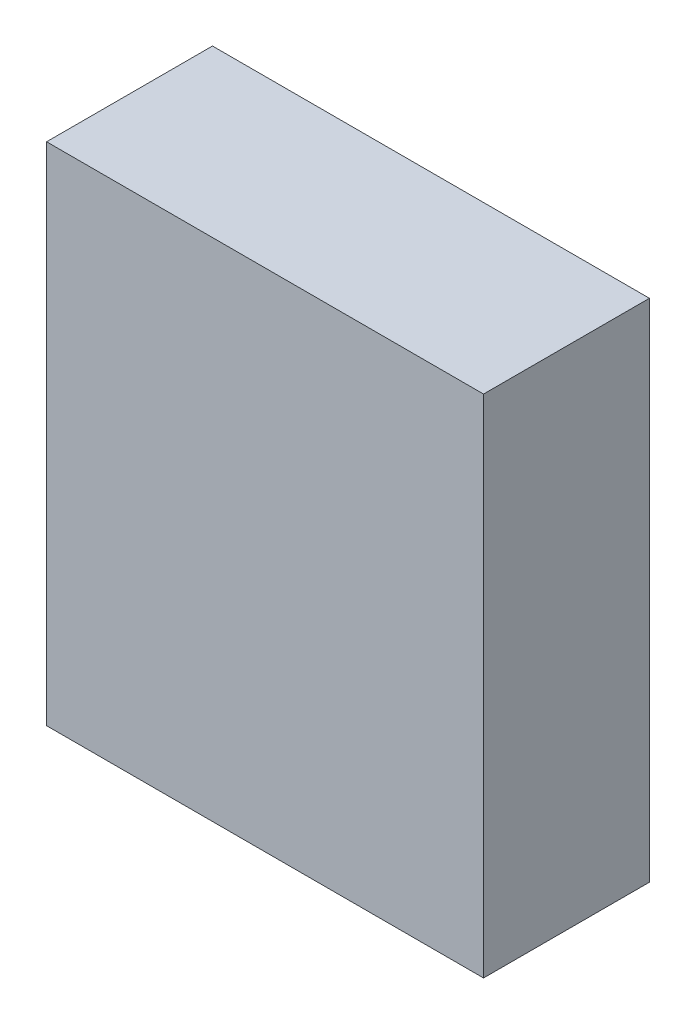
ISO-10303-21;
HEADER;
FILE_DESCRIPTION(('STEP AP214'),'2;1');
FILE_NAME('part.step','',(''),(''),'','','');
FILE_SCHEMA(('AUTOMOTIVE_DESIGN { 1 0 10303 214 1 1 1 1 }'));
ENDSEC;
DATA;
#1=APPLICATION_CONTEXT('core data for automotive mechanical design processes');
#2=APPLICATION_PROTOCOL_DEFINITION('international standard','automotive_design',2000,#1);
#3=PRODUCT_CONTEXT('',#1,'mechanical');
#4=PRODUCT('Part','Part','',(#3));
#5=PRODUCT_RELATED_PRODUCT_CATEGORY('part','',(#4));
#6=PRODUCT_DEFINITION_FORMATION('','',#4);
#7=PRODUCT_DEFINITION_CONTEXT('part definition',#1,'design');
#8=PRODUCT_DEFINITION('design','',#6,#7);
#9=PRODUCT_DEFINITION_SHAPE('','',#8);
#10=(LENGTH_UNIT() NAMED_UNIT(*) SI_UNIT(.MILLI.,.METRE.));
#11=(NAMED_UNIT(*) PLANE_ANGLE_UNIT() SI_UNIT($,.RADIAN.));
#12=(NAMED_UNIT(*) SI_UNIT($,.STERADIAN.) SOLID_ANGLE_UNIT());
#13=UNCERTAINTY_MEASURE_WITH_UNIT(LENGTH_MEASURE(1.E-05),#10,'distance_accuracy_value','');
#14=(GEOMETRIC_REPRESENTATION_CONTEXT(3) GLOBAL_UNCERTAINTY_ASSIGNED_CONTEXT((#13)) GLOBAL_UNIT_ASSIGNED_CONTEXT((#10,
#11,#12)) REPRESENTATION_CONTEXT('',''));
#15=CARTESIAN_POINT('',(0.,0.,0.));
#16=DIRECTION('',(0.,0.,1.));
#17=DIRECTION('',(1.,0.,0.));
#18=AXIS2_PLACEMENT_3D('',#15,#16,#17);
#19=CARTESIAN_POINT('',(216.,500.,-82.0000000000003));
#20=DIRECTION('',(-1.,0.,0.));
#21=DIRECTION('',(0.,0.,1.));
#22=AXIS2_PLACEMENT_3D('',#19,#20,#21);
#23=PLANE('',#22);
#24=DIRECTION('',(0.,0.,-1.));
#25=VECTOR('',#24,1.);
#26=CARTESIAN_POINT('',(216.,0.,-82.0000000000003));
#27=LINE('',#26,#25);
#28=CARTESIAN_POINT('',(216.,0.,82.0000000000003));
#29=VERTEX_POINT('',#28);
#30=CARTESIAN_POINT('',(216.,0.,-82.0000000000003));
#31=VERTEX_POINT('',#30);
#32=EDGE_CURVE('E93',#29,#31,#27,.T.);
#33=ORIENTED_EDGE('',*,*,#32,.T.);
#34=DIRECTION('',(0.,-1.,0.));
#35=VECTOR('',#34,1.);
#36=CARTESIAN_POINT('',(216.,500.,-82.0000000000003));
#37=LINE('',#36,#35);
#38=CARTESIAN_POINT('',(216.,500.,-82.0000000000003));
#39=VERTEX_POINT('',#38);
#40=EDGE_CURVE('E11',#39,#31,#37,.T.);
#41=ORIENTED_EDGE('',*,*,#40,.F.);
#42=DIRECTION('',(0.,0.,-1.));
#43=VECTOR('',#42,1.);
#44=CARTESIAN_POINT('',(216.,500.,-82.0000000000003));
#45=LINE('',#44,#43);
#46=CARTESIAN_POINT('',(216.,500.,82.0000000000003));
#47=VERTEX_POINT('',#46);
#48=EDGE_CURVE('E81',#47,#39,#45,.T.);
#49=ORIENTED_EDGE('',*,*,#48,.F.);
#50=DIRECTION('',(0.,-1.,0.));
#51=VECTOR('',#50,1.);
#52=CARTESIAN_POINT('',(216.,500.,82.0000000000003));
#53=LINE('',#52,#51);
#54=EDGE_CURVE('E89',#47,#29,#53,.T.);
#55=ORIENTED_EDGE('',*,*,#54,.T.);
#56=EDGE_LOOP('',(#33,#41,#49,#55));
#57=FACE_BOUND('',#56,.T.);
#58=ADVANCED_FACE('F30',(#57),#23,.F.);
#59=CARTESIAN_POINT('',(216.,500.,-82.0000000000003));
#60=DIRECTION('',(0.,0.,1.));
#61=DIRECTION('',(1.,0.,0.));
#62=AXIS2_PLACEMENT_3D('',#59,#60,#61);
#63=PLANE('',#62);
#64=DIRECTION('',(-1.,0.,0.));
#65=VECTOR('',#64,1.);
#66=CARTESIAN_POINT('',(216.,0.,-82.0000000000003));
#67=LINE('',#66,#65);
#68=CARTESIAN_POINT('',(-216.,0.,-82.0000000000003));
#69=VERTEX_POINT('',#68);
#70=EDGE_CURVE('E85',#31,#69,#67,.T.);
#71=ORIENTED_EDGE('',*,*,#70,.T.);
#72=DIRECTION('',(0.,-1.,0.));
#73=VECTOR('',#72,1.);
#74=CARTESIAN_POINT('',(-216.,500.,-82.0000000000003));
#75=LINE('',#74,#73);
#76=CARTESIAN_POINT('',(-216.,500.,-82.0000000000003));
#77=VERTEX_POINT('',#76);
#78=EDGE_CURVE('E38',#77,#69,#75,.T.);
#79=ORIENTED_EDGE('',*,*,#78,.F.);
#80=DIRECTION('',(-1.,0.,0.));
#81=VECTOR('',#80,1.);
#82=CARTESIAN_POINT('',(216.,500.,-82.0000000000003));
#83=LINE('',#82,#81);
#84=EDGE_CURVE('E76',#39,#77,#83,.T.);
#85=ORIENTED_EDGE('',*,*,#84,.F.);
#86=ORIENTED_EDGE('',*,*,#40,.T.);
#87=EDGE_LOOP('',(#71,#79,#85,#86));
#88=FACE_BOUND('',#87,.T.);
#89=ADVANCED_FACE('F84',(#88),#63,.F.);
#90=CARTESIAN_POINT('',(-216.,500.,-82.0000000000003));
#91=DIRECTION('',(1.,0.,0.));
#92=DIRECTION('',(0.,0.,-1.));
#93=AXIS2_PLACEMENT_3D('',#90,#91,#92);
#94=PLANE('',#93);
#95=DIRECTION('',(0.,0.,1.));
#96=VECTOR('',#95,1.);
#97=CARTESIAN_POINT('',(-216.,0.,-82.0000000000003));
#98=LINE('',#97,#96);
#99=CARTESIAN_POINT('',(-216.,0.,82.0000000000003));
#100=VERTEX_POINT('',#99);
#101=EDGE_CURVE('E63',#69,#100,#98,.T.);
#102=ORIENTED_EDGE('',*,*,#101,.T.);
#103=DIRECTION('',(0.,-1.,0.));
#104=VECTOR('',#103,1.);
#105=CARTESIAN_POINT('',(-216.,500.,82.0000000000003));
#106=LINE('',#105,#104);
#107=CARTESIAN_POINT('',(-216.,500.,82.0000000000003));
#108=VERTEX_POINT('',#107);
#109=EDGE_CURVE('E86',#108,#100,#106,.T.);
#110=ORIENTED_EDGE('',*,*,#109,.F.);
#111=DIRECTION('',(0.,0.,1.));
#112=VECTOR('',#111,1.);
#113=CARTESIAN_POINT('',(-216.,500.,-82.0000000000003));
#114=LINE('',#113,#112);
#115=EDGE_CURVE('E79',#77,#108,#114,.T.);
#116=ORIENTED_EDGE('',*,*,#115,.F.);
#117=ORIENTED_EDGE('',*,*,#78,.T.);
#118=EDGE_LOOP('',(#102,#110,#116,#117));
#119=FACE_BOUND('',#118,.T.);
#120=ADVANCED_FACE('F87',(#119),#94,.F.);
#121=CARTESIAN_POINT('',(216.,500.,82.0000000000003));
#122=DIRECTION('',(0.,0.,-1.));
#123=DIRECTION('',(-1.,0.,0.));
#124=AXIS2_PLACEMENT_3D('',#121,#122,#123);
#125=PLANE('',#124);
#126=DIRECTION('',(1.,0.,0.));
#127=VECTOR('',#126,1.);
#128=CARTESIAN_POINT('',(216.,0.,82.0000000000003));
#129=LINE('',#128,#127);
#130=EDGE_CURVE('E69',#100,#29,#129,.T.);
#131=ORIENTED_EDGE('',*,*,#130,.T.);
#132=ORIENTED_EDGE('',*,*,#54,.F.);
#133=DIRECTION('',(1.,0.,0.));
#134=VECTOR('',#133,1.);
#135=CARTESIAN_POINT('',(216.,500.,82.0000000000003));
#136=LINE('',#135,#134);
#137=EDGE_CURVE('E46',#108,#47,#136,.T.);
#138=ORIENTED_EDGE('',*,*,#137,.F.);
#139=ORIENTED_EDGE('',*,*,#109,.T.);
#140=EDGE_LOOP('',(#131,#132,#138,#139));
#141=FACE_BOUND('',#140,.T.);
#142=ADVANCED_FACE('F100',(#141),#125,.F.);
#143=CARTESIAN_POINT('',(216.,500.,82.0000000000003));
#144=DIRECTION('',(0.,-1.,0.));
#145=DIRECTION('',(0.,0.,-1.));
#146=AXIS2_PLACEMENT_3D('',#143,#144,#145);
#147=PLANE('',#146);
#148=ORIENTED_EDGE('',*,*,#48,.T.);
#149=ORIENTED_EDGE('',*,*,#84,.T.);
#150=ORIENTED_EDGE('',*,*,#115,.T.);
#151=ORIENTED_EDGE('',*,*,#137,.T.);
#152=EDGE_LOOP('',(#148,#149,#150,#151));
#153=FACE_BOUND('',#152,.T.);
#154=ADVANCED_FACE('F77',(#153),#147,.F.);
#155=CARTESIAN_POINT('',(216.,0.,82.0000000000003));
#156=DIRECTION('',(0.,-1.,0.));
#157=DIRECTION('',(0.,0.,-1.));
#158=AXIS2_PLACEMENT_3D('',#155,#156,#157);
#159=PLANE('',#158);
#160=ORIENTED_EDGE('',*,*,#32,.F.);
#161=ORIENTED_EDGE('',*,*,#130,.F.);
#162=ORIENTED_EDGE('',*,*,#101,.F.);
#163=ORIENTED_EDGE('',*,*,#70,.F.);
#164=EDGE_LOOP('',(#160,#161,#162,#163));
#165=FACE_BOUND('',#164,.T.);
#166=ADVANCED_FACE('F103',(#165),#159,.T.);
#167=CLOSED_SHELL('',(#58,#89,#120,#142,#154,#166));
#168=MANIFOLD_SOLID_BREP('B2',#167);
#169=ADVANCED_BREP_SHAPE_REPRESENTATION('',(#18,#168),#14);
#170=SHAPE_DEFINITION_REPRESENTATION(#9,#169);
ENDSEC;
END-ISO-10303-21;
